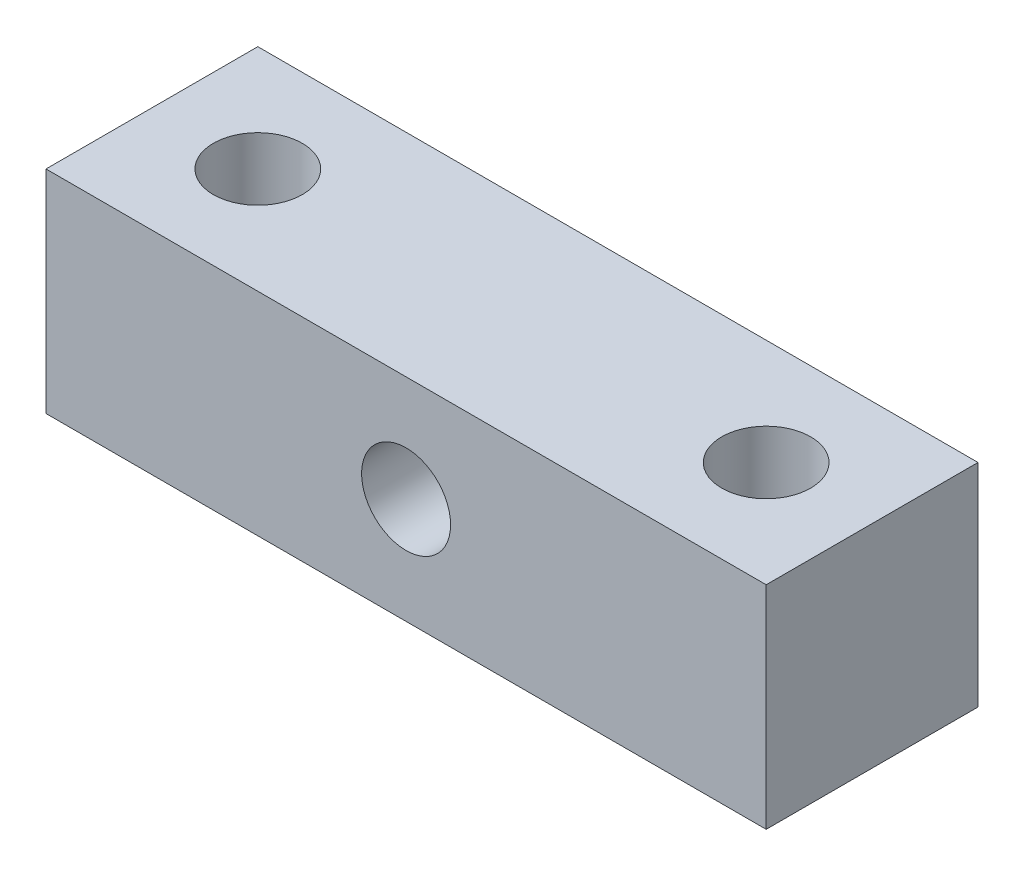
ISO-10303-21;
HEADER;
FILE_DESCRIPTION(('STEP AP214'),'2;1');
FILE_NAME('part.step','',(''),(''),'','','');
FILE_SCHEMA(('AUTOMOTIVE_DESIGN { 1 0 10303 214 1 1 1 1 }'));
ENDSEC;
DATA;
#1=APPLICATION_CONTEXT('core data for automotive mechanical design processes');
#2=APPLICATION_PROTOCOL_DEFINITION('international standard','automotive_design',2000,#1);
#3=PRODUCT_CONTEXT('',#1,'mechanical');
#4=PRODUCT('Part','Part','',(#3));
#5=PRODUCT_RELATED_PRODUCT_CATEGORY('part','',(#4));
#6=PRODUCT_DEFINITION_FORMATION('','',#4);
#7=PRODUCT_DEFINITION_CONTEXT('part definition',#1,'design');
#8=PRODUCT_DEFINITION('design','',#6,#7);
#9=PRODUCT_DEFINITION_SHAPE('','',#8);
#10=(LENGTH_UNIT() NAMED_UNIT(*) SI_UNIT(.MILLI.,.METRE.));
#11=(NAMED_UNIT(*) PLANE_ANGLE_UNIT() SI_UNIT($,.RADIAN.));
#12=(NAMED_UNIT(*) SI_UNIT($,.STERADIAN.) SOLID_ANGLE_UNIT());
#13=UNCERTAINTY_MEASURE_WITH_UNIT(LENGTH_MEASURE(1.E-05),#10,'distance_accuracy_value','');
#14=(GEOMETRIC_REPRESENTATION_CONTEXT(3) GLOBAL_UNCERTAINTY_ASSIGNED_CONTEXT((#13)) GLOBAL_UNIT_ASSIGNED_CONTEXT((#10,
#11,#12)) REPRESENTATION_CONTEXT('',''));
#15=CARTESIAN_POINT('',(0.,0.,0.));
#16=DIRECTION('',(0.,0.,1.));
#17=DIRECTION('',(1.,0.,0.));
#18=AXIS2_PLACEMENT_3D('',#15,#16,#17);
#19=CARTESIAN_POINT('',(0.,10.,0.));
#20=DIRECTION('',(1.,0.,0.));
#21=DIRECTION('',(0.,0.,-1.));
#22=AXIS2_PLACEMENT_3D('',#19,#20,#21);
#23=PLANE('',#22);
#24=DIRECTION('',(0.,0.,1.));
#25=VECTOR('',#24,1.);
#26=CARTESIAN_POINT('',(0.,0.,0.));
#27=LINE('',#26,#25);
#28=CARTESIAN_POINT('',(0.,0.,-10.));
#29=VERTEX_POINT('',#28);
#30=CARTESIAN_POINT('',(0.,0.,0.));
#31=VERTEX_POINT('',#30);
#32=EDGE_CURVE('E97',#29,#31,#27,.T.);
#33=ORIENTED_EDGE('',*,*,#32,.T.);
#34=DIRECTION('',(0.,-1.,0.));
#35=VECTOR('',#34,1.);
#36=CARTESIAN_POINT('',(0.,10.,0.));
#37=LINE('',#36,#35);
#38=CARTESIAN_POINT('',(0.,10.,0.));
#39=VERTEX_POINT('',#38);
#40=EDGE_CURVE('E11',#39,#31,#37,.T.);
#41=ORIENTED_EDGE('',*,*,#40,.F.);
#42=DIRECTION('',(0.,0.,1.));
#43=VECTOR('',#42,1.);
#44=CARTESIAN_POINT('',(0.,10.,0.));
#45=LINE('',#44,#43);
#46=CARTESIAN_POINT('',(0.,10.,-10.));
#47=VERTEX_POINT('',#46);
#48=EDGE_CURVE('E85',#47,#39,#45,.T.);
#49=ORIENTED_EDGE('',*,*,#48,.F.);
#50=DIRECTION('',(0.,-1.,0.));
#51=VECTOR('',#50,1.);
#52=CARTESIAN_POINT('',(0.,10.,-10.));
#53=LINE('',#52,#51);
#54=EDGE_CURVE('E93',#47,#29,#53,.T.);
#55=ORIENTED_EDGE('',*,*,#54,.T.);
#56=EDGE_LOOP('',(#33,#41,#49,#55));
#57=FACE_BOUND('',#56,.T.);
#58=ADVANCED_FACE('F34',(#57),#23,.F.);
#59=CARTESIAN_POINT('',(0.,10.,0.));
#60=DIRECTION('',(0.,0.,-1.));
#61=DIRECTION('',(-1.,0.,0.));
#62=AXIS2_PLACEMENT_3D('',#59,#60,#61);
#63=PLANE('',#62);
#64=CARTESIAN_POINT('',(17.,5.,0.));
#65=DIRECTION('',(0.,0.,1.));
#66=DIRECTION('',(1.,0.,0.));
#67=AXIS2_PLACEMENT_3D('',#64,#65,#66);
#68=CIRCLE('',#67,2.09999999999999);
#69=CARTESIAN_POINT('',(19.1,5.,0.));
#70=VERTEX_POINT('',#69);
#71=EDGE_CURVE('E113',#70,#70,#68,.T.);
#72=ORIENTED_EDGE('',*,*,#71,.F.);
#73=EDGE_LOOP('',(#72));
#74=FACE_BOUND('',#73,.T.);
#75=DIRECTION('',(1.,0.,0.));
#76=VECTOR('',#75,1.);
#77=CARTESIAN_POINT('',(0.,0.,0.));
#78=LINE('',#77,#76);
#79=CARTESIAN_POINT('',(34.,0.,0.));
#80=VERTEX_POINT('',#79);
#81=EDGE_CURVE('E89',#31,#80,#78,.T.);
#82=ORIENTED_EDGE('',*,*,#81,.T.);
#83=DIRECTION('',(0.,-1.,0.));
#84=VECTOR('',#83,1.);
#85=CARTESIAN_POINT('',(34.,10.,0.));
#86=LINE('',#85,#84);
#87=CARTESIAN_POINT('',(34.,10.,0.));
#88=VERTEX_POINT('',#87);
#89=EDGE_CURVE('E42',#88,#80,#86,.T.);
#90=ORIENTED_EDGE('',*,*,#89,.F.);
#91=DIRECTION('',(1.,0.,0.));
#92=VECTOR('',#91,1.);
#93=CARTESIAN_POINT('',(0.,10.,0.));
#94=LINE('',#93,#92);
#95=EDGE_CURVE('E80',#39,#88,#94,.T.);
#96=ORIENTED_EDGE('',*,*,#95,.F.);
#97=ORIENTED_EDGE('',*,*,#40,.T.);
#98=EDGE_LOOP('',(#82,#90,#96,#97));
#99=FACE_BOUND('',#98,.T.);
#100=ADVANCED_FACE('F88',(#74,#99),#63,.F.);
#101=CARTESIAN_POINT('',(34.,10.,0.));
#102=DIRECTION('',(-1.,0.,0.));
#103=DIRECTION('',(0.,0.,1.));
#104=AXIS2_PLACEMENT_3D('',#101,#102,#103);
#105=PLANE('',#104);
#106=DIRECTION('',(0.,0.,-1.));
#107=VECTOR('',#106,1.);
#108=CARTESIAN_POINT('',(34.,0.,0.));
#109=LINE('',#108,#107);
#110=CARTESIAN_POINT('',(34.,0.,-10.));
#111=VERTEX_POINT('',#110);
#112=EDGE_CURVE('E67',#80,#111,#109,.T.);
#113=ORIENTED_EDGE('',*,*,#112,.T.);
#114=DIRECTION('',(0.,-1.,0.));
#115=VECTOR('',#114,1.);
#116=CARTESIAN_POINT('',(34.,10.,-10.));
#117=LINE('',#116,#115);
#118=CARTESIAN_POINT('',(34.,10.,-10.));
#119=VERTEX_POINT('',#118);
#120=EDGE_CURVE('E90',#119,#111,#117,.T.);
#121=ORIENTED_EDGE('',*,*,#120,.F.);
#122=DIRECTION('',(0.,0.,-1.));
#123=VECTOR('',#122,1.);
#124=CARTESIAN_POINT('',(34.,10.,0.));
#125=LINE('',#124,#123);
#126=EDGE_CURVE('E83',#88,#119,#125,.T.);
#127=ORIENTED_EDGE('',*,*,#126,.F.);
#128=ORIENTED_EDGE('',*,*,#89,.T.);
#129=EDGE_LOOP('',(#113,#121,#127,#128));
#130=FACE_BOUND('',#129,.T.);
#131=ADVANCED_FACE('F91',(#130),#105,.F.);
#132=CARTESIAN_POINT('',(0.,10.,-10.));
#133=DIRECTION('',(0.,0.,1.));
#134=DIRECTION('',(1.,0.,0.));
#135=AXIS2_PLACEMENT_3D('',#132,#133,#134);
#136=PLANE('',#135);
#137=CARTESIAN_POINT('',(17.,5.,-10.));
#138=DIRECTION('',(0.,0.,1.));
#139=DIRECTION('',(1.,0.,0.));
#140=AXIS2_PLACEMENT_3D('',#137,#138,#139);
#141=CIRCLE('',#140,2.1);
#142=CARTESIAN_POINT('',(19.1,5.,-10.));
#143=VERTEX_POINT('',#142);
#144=EDGE_CURVE('E100',#143,#143,#141,.T.);
#145=ORIENTED_EDGE('',*,*,#144,.T.);
#146=EDGE_LOOP('',(#145));
#147=FACE_BOUND('',#146,.T.);
#148=DIRECTION('',(-1.,0.,0.));
#149=VECTOR('',#148,1.);
#150=CARTESIAN_POINT('',(0.,0.,-10.));
#151=LINE('',#150,#149);
#152=EDGE_CURVE('E73',#111,#29,#151,.T.);
#153=ORIENTED_EDGE('',*,*,#152,.T.);
#154=ORIENTED_EDGE('',*,*,#54,.F.);
#155=DIRECTION('',(-1.,0.,0.));
#156=VECTOR('',#155,1.);
#157=CARTESIAN_POINT('',(0.,10.,-10.));
#158=LINE('',#157,#156);
#159=EDGE_CURVE('E50',#119,#47,#158,.T.);
#160=ORIENTED_EDGE('',*,*,#159,.F.);
#161=ORIENTED_EDGE('',*,*,#120,.T.);
#162=EDGE_LOOP('',(#153,#154,#160,#161));
#163=FACE_BOUND('',#162,.T.);
#164=ADVANCED_FACE('F105',(#147,#163),#136,.F.);
#165=CARTESIAN_POINT('',(0.,10.,-10.));
#166=DIRECTION('',(0.,-1.,0.));
#167=DIRECTION('',(0.,0.,-1.));
#168=AXIS2_PLACEMENT_3D('',#165,#166,#167);
#169=PLANE('',#168);
#170=CARTESIAN_POINT('',(5.,10.,-5.));
#171=DIRECTION('',(0.,1.,0.));
#172=DIRECTION('',(0.,0.,1.));
#173=AXIS2_PLACEMENT_3D('',#170,#171,#172);
#174=CIRCLE('',#173,2.09999999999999);
#175=CARTESIAN_POINT('',(5.,10.,-2.90000000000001));
#176=VERTEX_POINT('',#175);
#177=EDGE_CURVE('E125',#176,#176,#174,.T.);
#178=ORIENTED_EDGE('',*,*,#177,.F.);
#179=EDGE_LOOP('',(#178));
#180=FACE_BOUND('',#179,.T.);
#181=CARTESIAN_POINT('',(29.,10.,-5.));
#182=DIRECTION('',(0.,1.,0.));
#183=DIRECTION('',(0.,0.,1.));
#184=AXIS2_PLACEMENT_3D('',#181,#182,#183);
#185=CIRCLE('',#184,2.09999999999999);
#186=CARTESIAN_POINT('',(29.,10.,-2.90000000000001));
#187=VERTEX_POINT('',#186);
#188=EDGE_CURVE('E119',#187,#187,#185,.T.);
#189=ORIENTED_EDGE('',*,*,#188,.F.);
#190=EDGE_LOOP('',(#189));
#191=FACE_BOUND('',#190,.T.);
#192=ORIENTED_EDGE('',*,*,#48,.T.);
#193=ORIENTED_EDGE('',*,*,#95,.T.);
#194=ORIENTED_EDGE('',*,*,#126,.T.);
#195=ORIENTED_EDGE('',*,*,#159,.T.);
#196=EDGE_LOOP('',(#192,#193,#194,#195));
#197=FACE_BOUND('',#196,.T.);
#198=ADVANCED_FACE('F81',(#180,#191,#197),#169,.F.);
#199=CARTESIAN_POINT('',(0.,0.,-10.));
#200=DIRECTION('',(0.,-1.,0.));
#201=DIRECTION('',(0.,0.,-1.));
#202=AXIS2_PLACEMENT_3D('',#199,#200,#201);
#203=PLANE('',#202);
#204=CARTESIAN_POINT('',(5.,0.,-5.));
#205=DIRECTION('',(0.,1.,0.));
#206=DIRECTION('',(0.,0.,1.));
#207=AXIS2_PLACEMENT_3D('',#204,#205,#206);
#208=CIRCLE('',#207,2.1);
#209=CARTESIAN_POINT('',(5.,0.,-2.9));
#210=VERTEX_POINT('',#209);
#211=EDGE_CURVE('E122',#210,#210,#208,.T.);
#212=ORIENTED_EDGE('',*,*,#211,.T.);
#213=EDGE_LOOP('',(#212));
#214=FACE_BOUND('',#213,.T.);
#215=CARTESIAN_POINT('',(29.,0.,-5.));
#216=DIRECTION('',(0.,1.,0.));
#217=DIRECTION('',(0.,0.,1.));
#218=AXIS2_PLACEMENT_3D('',#215,#216,#217);
#219=CIRCLE('',#218,2.1);
#220=CARTESIAN_POINT('',(29.,0.,-2.9));
#221=VERTEX_POINT('',#220);
#222=EDGE_CURVE('E116',#221,#221,#219,.T.);
#223=ORIENTED_EDGE('',*,*,#222,.T.);
#224=EDGE_LOOP('',(#223));
#225=FACE_BOUND('',#224,.T.);
#226=ORIENTED_EDGE('',*,*,#32,.F.);
#227=ORIENTED_EDGE('',*,*,#152,.F.);
#228=ORIENTED_EDGE('',*,*,#112,.F.);
#229=ORIENTED_EDGE('',*,*,#81,.F.);
#230=EDGE_LOOP('',(#226,#227,#228,#229));
#231=FACE_BOUND('',#230,.T.);
#232=ADVANCED_FACE('F108',(#214,#225,#231),#203,.T.);
#233=CARTESIAN_POINT('',(17.,5.,0.));
#234=DIRECTION('',(0.,0.,1.));
#235=DIRECTION('',(1.,0.,0.));
#236=AXIS2_PLACEMENT_3D('',#233,#234,#235);
#237=CYLINDRICAL_SURFACE('',#236,2.09999999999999);
#238=ORIENTED_EDGE('',*,*,#144,.F.);
#239=EDGE_LOOP('',(#238));
#240=FACE_BOUND('',#239,.T.);
#241=ORIENTED_EDGE('',*,*,#71,.T.);
#242=EDGE_LOOP('',(#241));
#243=FACE_BOUND('',#242,.T.);
#244=ADVANCED_FACE('F138',(#240,#243),#237,.F.);
#245=CARTESIAN_POINT('',(29.,10.,-5.));
#246=DIRECTION('',(0.,1.,0.));
#247=DIRECTION('',(0.,0.,1.));
#248=AXIS2_PLACEMENT_3D('',#245,#246,#247);
#249=CYLINDRICAL_SURFACE('',#248,2.09999999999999);
#250=ORIENTED_EDGE('',*,*,#222,.F.);
#251=EDGE_LOOP('',(#250));
#252=FACE_BOUND('',#251,.T.);
#253=ORIENTED_EDGE('',*,*,#188,.T.);
#254=EDGE_LOOP('',(#253));
#255=FACE_BOUND('',#254,.T.);
#256=ADVANCED_FACE('F136',(#252,#255),#249,.F.);
#257=CARTESIAN_POINT('',(5.,10.,-5.));
#258=DIRECTION('',(0.,1.,0.));
#259=DIRECTION('',(0.,0.,1.));
#260=AXIS2_PLACEMENT_3D('',#257,#258,#259);
#261=CYLINDRICAL_SURFACE('',#260,2.09999999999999);
#262=ORIENTED_EDGE('',*,*,#211,.F.);
#263=EDGE_LOOP('',(#262));
#264=FACE_BOUND('',#263,.T.);
#265=ORIENTED_EDGE('',*,*,#177,.T.);
#266=EDGE_LOOP('',(#265));
#267=FACE_BOUND('',#266,.T.);
#268=ADVANCED_FACE('F129',(#264,#267),#261,.F.);
#269=CLOSED_SHELL('',(#58,#100,#131,#164,#198,#232,#244,#256,#268));
#270=MANIFOLD_SOLID_BREP('B2',#269);
#271=ADVANCED_BREP_SHAPE_REPRESENTATION('',(#18,#270),#14);
#272=SHAPE_DEFINITION_REPRESENTATION(#9,#271);
ENDSEC;
END-ISO-10303-21;
